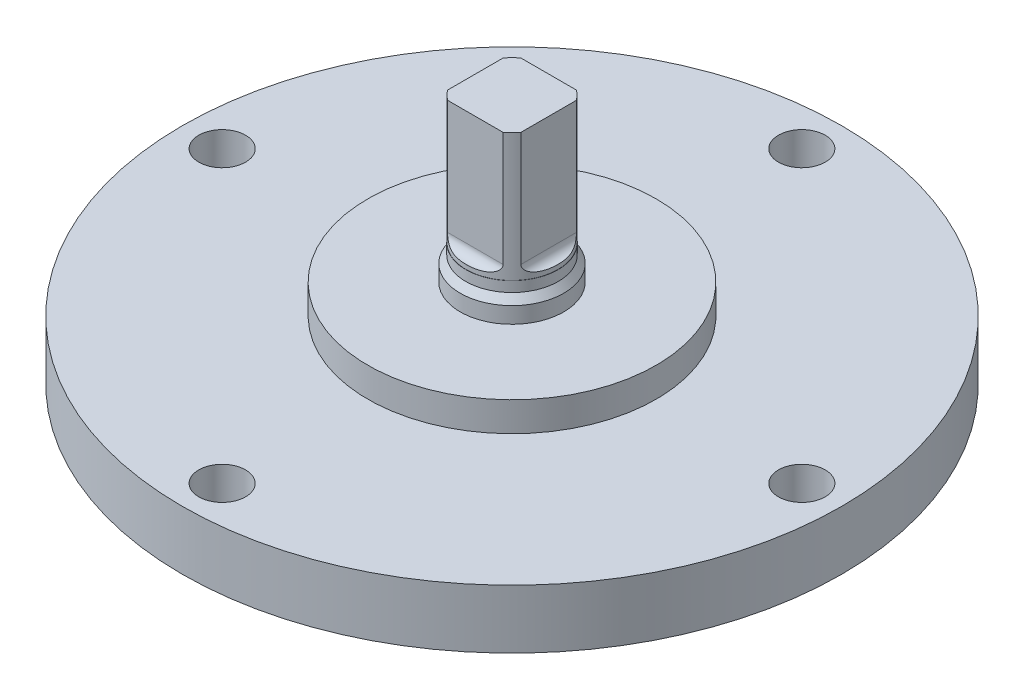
ISO-10303-21;
HEADER;
FILE_DESCRIPTION(('STEP AP214'),'2;1');
FILE_NAME('part.step','',(''),(''),'','','');
FILE_SCHEMA(('AUTOMOTIVE_DESIGN { 1 0 10303 214 1 1 1 1 }'));
ENDSEC;
DATA;
#1=APPLICATION_CONTEXT('core data for automotive mechanical design processes');
#2=APPLICATION_PROTOCOL_DEFINITION('international standard','automotive_design',2000,#1);
#3=PRODUCT_CONTEXT('',#1,'mechanical');
#4=PRODUCT('Part','Part','',(#3));
#5=PRODUCT_RELATED_PRODUCT_CATEGORY('part','',(#4));
#6=PRODUCT_DEFINITION_FORMATION('','',#4);
#7=PRODUCT_DEFINITION_CONTEXT('part definition',#1,'design');
#8=PRODUCT_DEFINITION('design','',#6,#7);
#9=PRODUCT_DEFINITION_SHAPE('','',#8);
#10=(LENGTH_UNIT() NAMED_UNIT(*) SI_UNIT(.MILLI.,.METRE.));
#11=(NAMED_UNIT(*) PLANE_ANGLE_UNIT() SI_UNIT($,.RADIAN.));
#12=(NAMED_UNIT(*) SI_UNIT($,.STERADIAN.) SOLID_ANGLE_UNIT());
#13=UNCERTAINTY_MEASURE_WITH_UNIT(LENGTH_MEASURE(1.E-05),#10,'distance_accuracy_value','');
#14=(GEOMETRIC_REPRESENTATION_CONTEXT(3) GLOBAL_UNCERTAINTY_ASSIGNED_CONTEXT((#13)) GLOBAL_UNIT_ASSIGNED_CONTEXT((#10,
#11,#12)) REPRESENTATION_CONTEXT('',''));
#15=CARTESIAN_POINT('',(0.,0.,0.));
#16=DIRECTION('',(0.,0.,1.));
#17=DIRECTION('',(1.,0.,0.));
#18=AXIS2_PLACEMENT_3D('',#15,#16,#17);
#19=CARTESIAN_POINT('',(0.,21.59,0.));
#20=DIRECTION('',(0.,1.,0.));
#21=DIRECTION('',(0.,0.,1.));
#22=AXIS2_PLACEMENT_3D('',#19,#20,#21);
#23=PLANE('',#22);
#24=CARTESIAN_POINT('',(0.,21.59,0.));
#25=DIRECTION('',(0.,-1.,0.));
#26=DIRECTION('',(0.,0.,-1.));
#27=AXIS2_PLACEMENT_3D('',#24,#25,#26);
#28=CIRCLE('',#27,3.96875);
#29=CARTESIAN_POINT('',(2.39808992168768,21.59,-3.1623));
#30=VERTEX_POINT('',#29);
#31=CARTESIAN_POINT('',(3.1623,21.59,-2.39808992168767));
#32=VERTEX_POINT('',#31);
#33=EDGE_CURVE('E148',#30,#32,#28,.T.);
#34=ORIENTED_EDGE('',*,*,#33,.F.);
#35=DIRECTION('',(-1.,0.,0.));
#36=VECTOR('',#35,1.);
#37=CARTESIAN_POINT('',(-2.39808992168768,21.59,-3.1623));
#38=LINE('',#37,#36);
#39=CARTESIAN_POINT('',(-2.39808992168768,21.59,-3.1623));
#40=VERTEX_POINT('',#39);
#41=EDGE_CURVE('E474',#30,#40,#38,.T.);
#42=ORIENTED_EDGE('',*,*,#41,.T.);
#43=CARTESIAN_POINT('',(-3.1623,21.59,-2.39808992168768));
#44=VERTEX_POINT('',#43);
#45=EDGE_CURVE('E137',#44,#40,#28,.T.);
#46=ORIENTED_EDGE('',*,*,#45,.F.);
#47=DIRECTION('',(0.,0.,1.));
#48=VECTOR('',#47,1.);
#49=CARTESIAN_POINT('',(-3.1623,21.59,2.39808992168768));
#50=LINE('',#49,#48);
#51=CARTESIAN_POINT('',(-3.1623,21.59,2.39808992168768));
#52=VERTEX_POINT('',#51);
#53=EDGE_CURVE('E122',#44,#52,#50,.T.);
#54=ORIENTED_EDGE('',*,*,#53,.T.);
#55=CARTESIAN_POINT('',(-2.39808992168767,21.59,3.1623));
#56=VERTEX_POINT('',#55);
#57=EDGE_CURVE('E134',#56,#52,#28,.T.);
#58=ORIENTED_EDGE('',*,*,#57,.F.);
#59=DIRECTION('',(1.,0.,0.));
#60=VECTOR('',#59,1.);
#61=CARTESIAN_POINT('',(2.39808992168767,21.59,3.1623));
#62=LINE('',#61,#60);
#63=CARTESIAN_POINT('',(2.39808992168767,21.59,3.1623));
#64=VERTEX_POINT('',#63);
#65=EDGE_CURVE('E138',#56,#64,#62,.T.);
#66=ORIENTED_EDGE('',*,*,#65,.T.);
#67=CARTESIAN_POINT('',(3.1623,21.59,2.39808992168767));
#68=VERTEX_POINT('',#67);
#69=EDGE_CURVE('E145',#68,#64,#28,.T.);
#70=ORIENTED_EDGE('',*,*,#69,.F.);
#71=DIRECTION('',(0.,0.,-1.));
#72=VECTOR('',#71,1.);
#73=CARTESIAN_POINT('',(3.1623,21.59,-2.39808992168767));
#74=LINE('',#73,#72);
#75=EDGE_CURVE('E471',#68,#32,#74,.T.);
#76=ORIENTED_EDGE('',*,*,#75,.T.);
#77=EDGE_LOOP('',(#34,#42,#46,#54,#58,#66,#70,#76));
#78=FACE_BOUND('',#77,.T.);
#79=ADVANCED_FACE('F28',(#78),#23,.T.);
#80=CARTESIAN_POINT('',(0.,0.,0.));
#81=DIRECTION('',(0.,-1.,0.));
#82=DIRECTION('',(0.,0.,-1.));
#83=AXIS2_PLACEMENT_3D('',#80,#81,#82);
#84=CYLINDRICAL_SURFACE('',#83,3.96875);
#85=DIRECTION('',(0.,1.,0.));
#86=VECTOR('',#85,1.);
#87=CARTESIAN_POINT('',(-3.1623,10.922,2.39808992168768));
#88=LINE('',#87,#86);
#89=CARTESIAN_POINT('',(-3.1623,11.71448,2.39808992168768));
#90=VERTEX_POINT('',#89);
#91=EDGE_CURVE('E118',#90,#52,#88,.T.);
#92=ORIENTED_EDGE('',*,*,#91,.F.);
#93=CARTESIAN_POINT('',(-3.1623,11.71448,2.39808992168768));
#94=CARTESIAN_POINT('',(-3.16229742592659,11.6986815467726,2.39809203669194));
#95=CARTESIAN_POINT('',(-3.16277291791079,11.6828936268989,2.39746640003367));
#96=CARTESIAN_POINT('',(-3.16465170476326,11.6514838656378,2.3949864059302));
#97=CARTESIAN_POINT('',(-3.1660541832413,11.6358618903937,2.39313312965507));
#98=CARTESIAN_POINT('',(-3.17157138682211,11.5897510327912,2.38582270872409));
#99=CARTESIAN_POINT('',(-3.17699722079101,11.5596743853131,2.37861362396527));
#100=CARTESIAN_POINT('',(-3.19081354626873,11.5017159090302,2.36004571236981));
#101=CARTESIAN_POINT('',(-3.19919495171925,11.473827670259,2.34869960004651));
#102=CARTESIAN_POINT('',(-3.21827527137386,11.4205611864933,2.32248677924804));
#103=CARTESIAN_POINT('',(-3.22897994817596,11.3951894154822,2.30761130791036));
#104=CARTESIAN_POINT('',(-3.25690781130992,11.3370765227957,2.26811073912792));
#105=CARTESIAN_POINT('',(-3.27497566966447,11.3057427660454,2.24202016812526));
#106=CARTESIAN_POINT('',(-3.31288727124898,11.2484514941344,2.18561669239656));
#107=CARTESIAN_POINT('',(-3.33273426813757,11.2225041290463,2.15529599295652));
#108=CARTESIAN_POINT('',(-3.38491538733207,11.1615706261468,2.07288981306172));
#109=CARTESIAN_POINT('',(-3.41774854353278,11.1302040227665,2.01846606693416));
#110=CARTESIAN_POINT('',(-3.48241887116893,11.0767801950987,1.9047464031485));
#111=CARTESIAN_POINT('',(-3.51425353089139,11.0547449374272,1.84543937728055));
#112=CARTESIAN_POINT('',(-3.57333405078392,11.0190518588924,1.72807892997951));
#113=CARTESIAN_POINT('',(-3.60074519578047,11.0048966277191,1.6702547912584));
#114=CARTESIAN_POINT('',(-3.65304701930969,10.9811265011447,1.55253976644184));
#115=CARTESIAN_POINT('',(-3.67793542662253,10.971515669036,1.49264708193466));
#116=CARTESIAN_POINT('',(-3.72494096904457,10.9556554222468,1.37114889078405));
#117=CARTESIAN_POINT('',(-3.74704920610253,10.9494165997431,1.30953861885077));
#118=CARTESIAN_POINT('',(-3.78824145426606,10.9394068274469,1.1851158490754));
#119=CARTESIAN_POINT('',(-3.80732490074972,10.935636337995,1.12230312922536));
#120=CARTESIAN_POINT('',(-3.84134380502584,10.9299826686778,0.999438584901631));
#121=CARTESIAN_POINT('',(-3.85645647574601,10.9280020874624,0.939439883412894));
#122=CARTESIAN_POINT('',(-3.88386565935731,10.9250592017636,0.818774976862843));
#123=CARTESIAN_POINT('',(-3.89616195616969,10.9240969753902,0.758108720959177));
#124=CARTESIAN_POINT('',(-3.91780026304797,10.9227886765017,0.636846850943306));
#125=CARTESIAN_POINT('',(-3.92716946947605,10.9224367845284,0.576256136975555));
#126=CARTESIAN_POINT('',(-3.94309098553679,10.9220505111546,0.454717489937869));
#127=CARTESIAN_POINT('',(-3.94964388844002,10.9220160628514,0.393769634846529));
#128=CARTESIAN_POINT('',(-3.95478,10.922,0.332703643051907));
#129=B_SPLINE_CURVE_WITH_KNOTS('',3,(#93,#94,#95,#96,#97,#98,#99,#100,#101,#102,#103,#104,#105,
#106,#107,#108,#109,#110,#111,#112,#113,#114,#115,#116,#117,#118,#119,#120,#121,#122,#123,#124,
#125,#126,#127,#128),.UNSPECIFIED.,.F.,.F.,(4,2,2,2,2,2,2,2,2,2,2,2,2,2,2,2,2,4),(0.,
0.0473559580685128,0.0946702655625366,0.188287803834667,0.281620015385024,0.375186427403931,
0.508230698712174,0.641523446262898,0.852963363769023,1.06489829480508,1.26122676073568,
1.45773043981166,1.65484784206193,1.85200199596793,2.0376366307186,2.22328550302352,
2.40715430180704,2.59098434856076),.UNSPECIFIED.);
#130=CARTESIAN_POINT('',(-3.95478,10.922,0.332703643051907));
#131=VERTEX_POINT('',#130);
#132=EDGE_CURVE('E39',#90,#131,#129,.T.);
#133=ORIENTED_EDGE('',*,*,#132,.T.);
#134=CARTESIAN_POINT('',(0.,10.922,0.));
#135=DIRECTION('',(0.,1.,0.));
#136=DIRECTION('',(0.,0.,1.));
#137=AXIS2_PLACEMENT_3D('',#134,#135,#136);
#138=CIRCLE('',#137,3.96875);
#139=CARTESIAN_POINT('',(-3.95478,10.922,-0.332703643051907));
#140=VERTEX_POINT('',#139);
#141=EDGE_CURVE('E153',#131,#140,#138,.F.);
#142=ORIENTED_EDGE('',*,*,#141,.T.);
#143=CARTESIAN_POINT('',(-3.95478,10.922,-0.332703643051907));
#144=CARTESIAN_POINT('',(-3.95030195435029,10.922009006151,-0.385938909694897));
#145=CARTESIAN_POINT('',(-3.94474804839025,10.922038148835,-0.439083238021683));
#146=CARTESIAN_POINT('',(-3.93149913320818,10.9223119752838,-0.545110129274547));
#147=CARTESIAN_POINT('',(-3.92380386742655,10.9225566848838,-0.597992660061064));
#148=CARTESIAN_POINT('',(-3.90624057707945,10.9234391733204,-0.703664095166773));
#149=CARTESIAN_POINT('',(-3.89636198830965,10.9240788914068,-0.756451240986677));
#150=CARTESIAN_POINT('',(-3.87447733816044,10.9260034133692,-0.861560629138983));
#151=CARTESIAN_POINT('',(-3.86247138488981,10.9272881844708,-0.913882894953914));
#152=CARTESIAN_POINT('',(-3.82301721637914,10.9325688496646,-1.07109774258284));
#153=CARTESIAN_POINT('',(-3.79230886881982,10.9379934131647,-1.17517607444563));
#154=CARTESIAN_POINT('',(-3.74015317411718,10.9514106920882,-1.32858883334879));
#155=CARTESIAN_POINT('',(-3.72177542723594,10.9567546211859,-1.37922265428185));
#156=CARTESIAN_POINT('',(-3.68308509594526,10.9697485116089,-1.47943907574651));
#157=CARTESIAN_POINT('',(-3.662773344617,10.9773974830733,-1.52902211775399));
#158=CARTESIAN_POINT('',(-3.62999630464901,10.9915012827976,-1.60466589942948));
#159=CARTESIAN_POINT('',(-3.61815268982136,10.9969230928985,-1.63119119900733));
#160=CARTESIAN_POINT('',(-3.59397589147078,11.0087703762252,-1.68379109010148));
#161=CARTESIAN_POINT('',(-3.58164268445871,11.0151958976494,-1.70986565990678));
#162=CARTESIAN_POINT('',(-3.54399650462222,11.0361665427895,-1.78727395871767));
#163=CARTESIAN_POINT('',(-3.51801325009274,11.0524153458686,-1.83784687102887));
#164=CARTESIAN_POINT('',(-3.46466464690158,11.0908588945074,-1.93655584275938));
#165=CARTESIAN_POINT('',(-3.43728972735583,11.1131012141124,-1.98466857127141));
#166=CARTESIAN_POINT('',(-3.38246498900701,11.1650231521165,-2.07671689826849));
#167=CARTESIAN_POINT('',(-3.35501538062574,11.194689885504,-2.12065955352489));
#168=CARTESIAN_POINT('',(-3.31157346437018,11.2507217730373,-2.18756438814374));
#169=CARTESIAN_POINT('',(-3.29501725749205,11.2744236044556,-2.21238038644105));
#170=CARTESIAN_POINT('',(-3.26347166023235,11.3258596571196,-2.2586518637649));
#171=CARTESIAN_POINT('',(-3.24848104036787,11.3535906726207,-2.28010998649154));
#172=CARTESIAN_POINT('',(-3.2232712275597,11.4084102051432,-2.3155772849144));
#173=CARTESIAN_POINT('',(-3.21267236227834,11.4349041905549,-2.3302280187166));
#174=CARTESIAN_POINT('',(-3.19405369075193,11.4904802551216,-2.35568358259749));
#175=CARTESIAN_POINT('',(-3.18602764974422,11.5195558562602,-2.3664977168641));
#176=CARTESIAN_POINT('',(-3.1740424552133,11.5759442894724,-2.38254582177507));
#177=CARTESIAN_POINT('',(-3.16970050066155,11.603023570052,-2.38830812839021));
#178=CARTESIAN_POINT('',(-3.16379958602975,11.6582055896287,-2.39611269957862));
#179=CARTESIAN_POINT('',(-3.16226124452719,11.6863143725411,-2.39812740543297));
#180=CARTESIAN_POINT('',(-3.1623,11.71448,-2.39808992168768));
#181=B_SPLINE_CURVE_WITH_KNOTS('',3,(#143,#144,#145,#146,#147,#148,#149,#150,#151,#152,#153,
#154,#155,#156,#157,#158,#159,#160,#161,#162,#163,#164,#165,#166,#167,#168,#169,#170,#171,#172,
#173,#174,#175,#176,#177,#178,#179,#180),.UNSPECIFIED.,.F.,.F.,(4,2,2,2,2,2,2,2,2,2,2,2,2,2,2,2,
2,2,4),(0.,0.160257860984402,0.320534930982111,0.481605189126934,0.642667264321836,
0.968012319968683,1.13033627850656,1.2925906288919,1.38122147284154,1.46985657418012,
1.64694646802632,1.82548568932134,2.00371718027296,2.11771547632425,2.23162356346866,
2.32748138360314,2.42310512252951,2.50678299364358,2.59107381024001),.UNSPECIFIED.);
#182=CARTESIAN_POINT('',(-3.1623,11.71448,-2.39808992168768));
#183=VERTEX_POINT('',#182);
#184=EDGE_CURVE('E11',#140,#183,#181,.T.);
#185=ORIENTED_EDGE('',*,*,#184,.T.);
#186=DIRECTION('',(0.,1.,0.));
#187=VECTOR('',#186,1.);
#188=CARTESIAN_POINT('',(-3.1623,10.922,-2.39808992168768));
#189=LINE('',#188,#187);
#190=EDGE_CURVE('E128',#183,#44,#189,.T.);
#191=ORIENTED_EDGE('',*,*,#190,.T.);
#192=ORIENTED_EDGE('',*,*,#45,.T.);
#193=DIRECTION('',(0.,1.,0.));
#194=VECTOR('',#193,1.);
#195=CARTESIAN_POINT('',(-2.39808992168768,10.922,-3.1623));
#196=LINE('',#195,#194);
#197=CARTESIAN_POINT('',(-2.39808992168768,11.71448,-3.1623));
#198=VERTEX_POINT('',#197);
#199=EDGE_CURVE('E476',#198,#40,#196,.T.);
#200=ORIENTED_EDGE('',*,*,#199,.F.);
#201=CARTESIAN_POINT('',(-2.39808992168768,11.71448,-3.1623));
#202=CARTESIAN_POINT('',(-2.39809203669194,11.6986815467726,-3.16229742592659));
#203=CARTESIAN_POINT('',(-2.39746640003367,11.6828936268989,-3.16277291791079));
#204=CARTESIAN_POINT('',(-2.3949864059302,11.6514838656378,-3.16465170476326));
#205=CARTESIAN_POINT('',(-2.39313312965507,11.6358618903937,-3.1660541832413));
#206=CARTESIAN_POINT('',(-2.38582270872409,11.5897510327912,-3.17157138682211));
#207=CARTESIAN_POINT('',(-2.37861362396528,11.5596743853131,-3.17699722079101));
#208=CARTESIAN_POINT('',(-2.36004571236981,11.5017159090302,-3.19081354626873));
#209=CARTESIAN_POINT('',(-2.34869960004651,11.473827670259,-3.19919495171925));
#210=CARTESIAN_POINT('',(-2.32248677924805,11.4205611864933,-3.21827527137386));
#211=CARTESIAN_POINT('',(-2.30761130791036,11.3951894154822,-3.22897994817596));
#212=CARTESIAN_POINT('',(-2.26811073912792,11.3370765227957,-3.25690781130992));
#213=CARTESIAN_POINT('',(-2.24202016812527,11.3057427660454,-3.27497566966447));
#214=CARTESIAN_POINT('',(-2.18561669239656,11.2484514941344,-3.31288727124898));
#215=CARTESIAN_POINT('',(-2.15529599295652,11.2225041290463,-3.33273426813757));
#216=CARTESIAN_POINT('',(-2.07288981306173,11.1615706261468,-3.38491538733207));
#217=CARTESIAN_POINT('',(-2.01846606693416,11.1302040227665,-3.41774854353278));
#218=CARTESIAN_POINT('',(-1.9047464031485,11.0767801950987,-3.48241887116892));
#219=CARTESIAN_POINT('',(-1.84543937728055,11.0547449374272,-3.51425353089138));
#220=CARTESIAN_POINT('',(-1.72807892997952,11.0190518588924,-3.57333405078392));
#221=CARTESIAN_POINT('',(-1.6702547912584,11.0048966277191,-3.60074519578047));
#222=CARTESIAN_POINT('',(-1.55253976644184,10.9811265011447,-3.65304701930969));
#223=CARTESIAN_POINT('',(-1.49264708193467,10.971515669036,-3.67793542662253));
#224=CARTESIAN_POINT('',(-1.37114889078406,10.9556554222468,-3.72494096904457));
#225=CARTESIAN_POINT('',(-1.30953861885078,10.9494165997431,-3.74704920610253));
#226=CARTESIAN_POINT('',(-1.1851158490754,10.9394068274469,-3.78824145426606));
#227=CARTESIAN_POINT('',(-1.12230312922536,10.935636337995,-3.80732490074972));
#228=CARTESIAN_POINT('',(-0.999438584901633,10.9299826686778,-3.84134380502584));
#229=CARTESIAN_POINT('',(-0.939439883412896,10.9280020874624,-3.85645647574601));
#230=CARTESIAN_POINT('',(-0.818774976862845,10.9250592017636,-3.88386565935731));
#231=CARTESIAN_POINT('',(-0.758108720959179,10.9240969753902,-3.89616195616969));
#232=CARTESIAN_POINT('',(-0.636846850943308,10.9227886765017,-3.91780026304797));
#233=CARTESIAN_POINT('',(-0.576256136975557,10.9224367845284,-3.92716946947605));
#234=CARTESIAN_POINT('',(-0.45471748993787,10.9220505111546,-3.94309098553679));
#235=CARTESIAN_POINT('',(-0.39376963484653,10.9220160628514,-3.94964388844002));
#236=CARTESIAN_POINT('',(-0.332703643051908,10.922,-3.95478));
#237=B_SPLINE_CURVE_WITH_KNOTS('',3,(#201,#202,#203,#204,#205,#206,#207,#208,#209,#210,#211,
#212,#213,#214,#215,#216,#217,#218,#219,#220,#221,#222,#223,#224,#225,#226,#227,#228,#229,#230,
#231,#232,#233,#234,#235,#236),.UNSPECIFIED.,.F.,.F.,(4,2,2,2,2,2,2,2,2,2,2,2,2,2,2,2,2,4),(0.,
0.0473559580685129,0.0946702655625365,0.188287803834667,0.281620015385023,0.375186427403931,
0.508230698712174,0.641523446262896,0.85296336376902,1.06489829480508,1.26122676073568,
1.45773043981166,1.65484784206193,1.85200199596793,2.0376366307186,2.22328550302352,
2.40715430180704,2.59098434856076),.UNSPECIFIED.);
#238=CARTESIAN_POINT('',(-0.332703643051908,10.922,-3.95478));
#239=VERTEX_POINT('',#238);
#240=EDGE_CURVE('E213',#198,#239,#237,.T.);
#241=ORIENTED_EDGE('',*,*,#240,.T.);
#242=CARTESIAN_POINT('',(0.332703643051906,10.922,-3.95478));
#243=VERTEX_POINT('',#242);
#244=EDGE_CURVE('E157',#239,#243,#138,.F.);
#245=ORIENTED_EDGE('',*,*,#244,.T.);
#246=CARTESIAN_POINT('',(0.332703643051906,10.922,-3.95478));
#247=CARTESIAN_POINT('',(0.385938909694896,10.922009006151,-3.95030195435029));
#248=CARTESIAN_POINT('',(0.439083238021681,10.922038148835,-3.94474804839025));
#249=CARTESIAN_POINT('',(0.545110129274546,10.9223119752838,-3.93149913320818));
#250=CARTESIAN_POINT('',(0.597992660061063,10.9225566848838,-3.92380386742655));
#251=CARTESIAN_POINT('',(0.703664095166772,10.9234391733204,-3.90624057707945));
#252=CARTESIAN_POINT('',(0.756451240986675,10.9240788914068,-3.89636198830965));
#253=CARTESIAN_POINT('',(0.861560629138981,10.9260034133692,-3.87447733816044));
#254=CARTESIAN_POINT('',(0.913882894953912,10.9272881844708,-3.86247138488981));
#255=CARTESIAN_POINT('',(1.07109774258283,10.9325688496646,-3.82301721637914));
#256=CARTESIAN_POINT('',(1.17517607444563,10.9379934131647,-3.79230886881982));
#257=CARTESIAN_POINT('',(1.32858883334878,10.9514106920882,-3.74015317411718));
#258=CARTESIAN_POINT('',(1.37922265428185,10.9567546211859,-3.72177542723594));
#259=CARTESIAN_POINT('',(1.4794390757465,10.9697485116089,-3.68308509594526));
#260=CARTESIAN_POINT('',(1.52902211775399,10.9773974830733,-3.662773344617));
#261=CARTESIAN_POINT('',(1.60466589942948,10.9915012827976,-3.62999630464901));
#262=CARTESIAN_POINT('',(1.63119119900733,10.9969230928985,-3.61815268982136));
#263=CARTESIAN_POINT('',(1.68379109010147,11.0087703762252,-3.59397589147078));
#264=CARTESIAN_POINT('',(1.70986565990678,11.0151958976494,-3.58164268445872));
#265=CARTESIAN_POINT('',(1.78727395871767,11.0361665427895,-3.54399650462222));
#266=CARTESIAN_POINT('',(1.83784687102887,11.0524153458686,-3.51801325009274));
#267=CARTESIAN_POINT('',(1.93655584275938,11.0908588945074,-3.46466464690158));
#268=CARTESIAN_POINT('',(1.98466857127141,11.1131012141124,-3.43728972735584));
#269=CARTESIAN_POINT('',(2.07671689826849,11.1650231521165,-3.38246498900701));
#270=CARTESIAN_POINT('',(2.12065955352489,11.194689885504,-3.35501538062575));
#271=CARTESIAN_POINT('',(2.18756438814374,11.2507217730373,-3.31157346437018));
#272=CARTESIAN_POINT('',(2.21238038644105,11.2744236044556,-3.29501725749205));
#273=CARTESIAN_POINT('',(2.2586518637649,11.3258596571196,-3.26347166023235));
#274=CARTESIAN_POINT('',(2.28010998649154,11.3535906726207,-3.24848104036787));
#275=CARTESIAN_POINT('',(2.3155772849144,11.4084102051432,-3.2232712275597));
#276=CARTESIAN_POINT('',(2.3302280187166,11.4349041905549,-3.21267236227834));
#277=CARTESIAN_POINT('',(2.35568358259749,11.4904802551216,-3.19405369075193));
#278=CARTESIAN_POINT('',(2.3664977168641,11.5195558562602,-3.18602764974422));
#279=CARTESIAN_POINT('',(2.38254582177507,11.5759442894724,-3.1740424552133));
#280=CARTESIAN_POINT('',(2.38830812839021,11.603023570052,-3.16970050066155));
#281=CARTESIAN_POINT('',(2.39611269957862,11.6582055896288,-3.16379958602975));
#282=CARTESIAN_POINT('',(2.39812740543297,11.6863143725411,-3.16226124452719));
#283=CARTESIAN_POINT('',(2.39808992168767,11.71448,-3.1623));
#284=B_SPLINE_CURVE_WITH_KNOTS('',3,(#246,#247,#248,#249,#250,#251,#252,#253,#254,#255,#256,
#257,#258,#259,#260,#261,#262,#263,#264,#265,#266,#267,#268,#269,#270,#271,#272,#273,#274,#275,
#276,#277,#278,#279,#280,#281,#282,#283),.UNSPECIFIED.,.F.,.F.,(4,2,2,2,2,2,2,2,2,2,2,2,2,2,2,2,
2,2,4),(0.,0.160257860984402,0.320534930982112,0.481605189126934,0.642667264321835,
0.968012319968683,1.13033627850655,1.2925906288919,1.38122147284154,1.46985657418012,
1.64694646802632,1.82548568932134,2.00371718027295,2.11771547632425,2.23162356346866,
2.32748138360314,2.42310512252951,2.50678299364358,2.59107381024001),.UNSPECIFIED.);
#285=CARTESIAN_POINT('',(2.39808992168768,11.71448,-3.1623));
#286=VERTEX_POINT('',#285);
#287=EDGE_CURVE('E219',#243,#286,#284,.T.);
#288=ORIENTED_EDGE('',*,*,#287,.T.);
#289=DIRECTION('',(0.,1.,0.));
#290=VECTOR('',#289,1.);
#291=CARTESIAN_POINT('',(2.39808992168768,10.922,-3.1623));
#292=LINE('',#291,#290);
#293=EDGE_CURVE('E479',#286,#30,#292,.T.);
#294=ORIENTED_EDGE('',*,*,#293,.T.);
#295=ORIENTED_EDGE('',*,*,#33,.T.);
#296=DIRECTION('',(0.,1.,0.));
#297=VECTOR('',#296,1.);
#298=CARTESIAN_POINT('',(3.1623,10.922,-2.39808992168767));
#299=LINE('',#298,#297);
#300=CARTESIAN_POINT('',(3.1623,11.71448,-2.39808992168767));
#301=VERTEX_POINT('',#300);
#302=EDGE_CURVE('E481',#301,#32,#299,.T.);
#303=ORIENTED_EDGE('',*,*,#302,.F.);
#304=CARTESIAN_POINT('',(3.1623,11.71448,-2.39808992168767));
#305=CARTESIAN_POINT('',(3.16229742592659,11.6986815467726,-2.39809203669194));
#306=CARTESIAN_POINT('',(3.16277291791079,11.6828936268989,-2.39746640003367));
#307=CARTESIAN_POINT('',(3.16465170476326,11.6514838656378,-2.39498640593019));
#308=CARTESIAN_POINT('',(3.16605418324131,11.6358618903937,-2.39313312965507));
#309=CARTESIAN_POINT('',(3.17157138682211,11.5897510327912,-2.38582270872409));
#310=CARTESIAN_POINT('',(3.17699722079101,11.5596743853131,-2.37861362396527));
#311=CARTESIAN_POINT('',(3.19081354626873,11.5017159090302,-2.3600457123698));
#312=CARTESIAN_POINT('',(3.19919495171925,11.473827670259,-2.34869960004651));
#313=CARTESIAN_POINT('',(3.21827527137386,11.4205611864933,-2.32248677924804));
#314=CARTESIAN_POINT('',(3.22897994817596,11.3951894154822,-2.30761130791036));
#315=CARTESIAN_POINT('',(3.25690781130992,11.3370765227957,-2.26811073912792));
#316=CARTESIAN_POINT('',(3.27497566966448,11.3057427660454,-2.24202016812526));
#317=CARTESIAN_POINT('',(3.31288727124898,11.2484514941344,-2.18561669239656));
#318=CARTESIAN_POINT('',(3.33273426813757,11.2225041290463,-2.15529599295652));
#319=CARTESIAN_POINT('',(3.38491538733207,11.1615706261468,-2.07288981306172));
#320=CARTESIAN_POINT('',(3.41774854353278,11.1302040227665,-2.01846606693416));
#321=CARTESIAN_POINT('',(3.48241887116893,11.0767801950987,-1.9047464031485));
#322=CARTESIAN_POINT('',(3.51425353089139,11.0547449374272,-1.84543937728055));
#323=CARTESIAN_POINT('',(3.57333405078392,11.0190518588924,-1.72807892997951));
#324=CARTESIAN_POINT('',(3.60074519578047,11.0048966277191,-1.6702547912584));
#325=CARTESIAN_POINT('',(3.65304701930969,10.9811265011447,-1.55253976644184));
#326=CARTESIAN_POINT('',(3.67793542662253,10.971515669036,-1.49264708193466));
#327=CARTESIAN_POINT('',(3.72494096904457,10.9556554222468,-1.37114889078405));
#328=CARTESIAN_POINT('',(3.74704920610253,10.9494165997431,-1.30953861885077));
#329=CARTESIAN_POINT('',(3.78824145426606,10.9394068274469,-1.1851158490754));
#330=CARTESIAN_POINT('',(3.80732490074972,10.935636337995,-1.12230312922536));
#331=CARTESIAN_POINT('',(3.84134380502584,10.9299826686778,-0.99943858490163));
#332=CARTESIAN_POINT('',(3.85645647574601,10.9280020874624,-0.939439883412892));
#333=CARTESIAN_POINT('',(3.88386565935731,10.9250592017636,-0.818774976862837));
#334=CARTESIAN_POINT('',(3.89616195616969,10.9240969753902,-0.758108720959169));
#335=CARTESIAN_POINT('',(3.91780026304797,10.9227886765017,-0.636846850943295));
#336=CARTESIAN_POINT('',(3.92716946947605,10.9224367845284,-0.576256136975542));
#337=CARTESIAN_POINT('',(3.94309098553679,10.9220505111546,-0.454717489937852));
#338=CARTESIAN_POINT('',(3.94964388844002,10.9220160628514,-0.39376963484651));
#339=CARTESIAN_POINT('',(3.95478,10.922,-0.332703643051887));
#340=B_SPLINE_CURVE_WITH_KNOTS('',3,(#304,#305,#306,#307,#308,#309,#310,#311,#312,#313,#314,
#315,#316,#317,#318,#319,#320,#321,#322,#323,#324,#325,#326,#327,#328,#329,#330,#331,#332,#333,
#334,#335,#336,#337,#338,#339),.UNSPECIFIED.,.F.,.F.,(4,2,2,2,2,2,2,2,2,2,2,2,2,2,2,2,2,4),(0.,
0.0473559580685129,0.0946702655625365,0.188287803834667,0.281620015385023,0.375186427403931,
0.508230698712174,0.641523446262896,0.85296336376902,1.06489829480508,1.26122676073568,
1.45773043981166,1.65484784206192,1.85200199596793,2.0376366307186,2.22328550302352,
2.40715430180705,2.59098434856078),.UNSPECIFIED.);
#341=CARTESIAN_POINT('',(3.95478,10.922,-0.332703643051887));
#342=VERTEX_POINT('',#341);
#343=EDGE_CURVE('E176',#301,#342,#340,.T.);
#344=ORIENTED_EDGE('',*,*,#343,.T.);
#345=CARTESIAN_POINT('',(3.95478,10.922,0.332703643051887));
#346=VERTEX_POINT('',#345);
#347=EDGE_CURVE('E158',#342,#346,#138,.F.);
#348=ORIENTED_EDGE('',*,*,#347,.T.);
#349=CARTESIAN_POINT('',(3.95478,10.922,0.332703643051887));
#350=CARTESIAN_POINT('',(3.95030195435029,10.922009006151,0.385938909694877));
#351=CARTESIAN_POINT('',(3.94474804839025,10.922038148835,0.439083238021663));
#352=CARTESIAN_POINT('',(3.93149913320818,10.9223119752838,0.545110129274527));
#353=CARTESIAN_POINT('',(3.92380386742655,10.9225566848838,0.597992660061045));
#354=CARTESIAN_POINT('',(3.90624057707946,10.9234391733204,0.703664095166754));
#355=CARTESIAN_POINT('',(3.89636198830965,10.9240788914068,0.756451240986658));
#356=CARTESIAN_POINT('',(3.87447733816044,10.9260034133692,0.861560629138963));
#357=CARTESIAN_POINT('',(3.86247138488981,10.9272881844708,0.913882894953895));
#358=CARTESIAN_POINT('',(3.82301721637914,10.9325688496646,1.07109774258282));
#359=CARTESIAN_POINT('',(3.79230886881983,10.9379934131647,1.17517607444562));
#360=CARTESIAN_POINT('',(3.74015317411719,10.9514106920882,1.32858883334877));
#361=CARTESIAN_POINT('',(3.72177542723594,10.9567546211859,1.37922265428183));
#362=CARTESIAN_POINT('',(3.68308509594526,10.9697485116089,1.47943907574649));
#363=CARTESIAN_POINT('',(3.662773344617,10.9773974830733,1.52902211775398));
#364=CARTESIAN_POINT('',(3.62999630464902,10.9915012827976,1.60466589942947));
#365=CARTESIAN_POINT('',(3.61815268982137,10.9969230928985,1.63119119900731));
#366=CARTESIAN_POINT('',(3.59397589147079,11.0087703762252,1.68379109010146));
#367=CARTESIAN_POINT('',(3.58164268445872,11.0151958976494,1.70986565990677));
#368=CARTESIAN_POINT('',(3.54399650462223,11.0361665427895,1.78727395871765));
#369=CARTESIAN_POINT('',(3.51801325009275,11.0524153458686,1.83784687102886));
#370=CARTESIAN_POINT('',(3.46466464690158,11.0908588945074,1.93655584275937));
#371=CARTESIAN_POINT('',(3.43728972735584,11.1131012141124,1.9846685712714));
#372=CARTESIAN_POINT('',(3.38246498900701,11.1650231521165,2.07671689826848));
#373=CARTESIAN_POINT('',(3.35501538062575,11.194689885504,2.12065955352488));
#374=CARTESIAN_POINT('',(3.31157346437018,11.2507217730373,2.18756438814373));
#375=CARTESIAN_POINT('',(3.29501725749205,11.2744236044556,2.21238038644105));
#376=CARTESIAN_POINT('',(3.26347166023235,11.3258596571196,2.2586518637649));
#377=CARTESIAN_POINT('',(3.24848104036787,11.3535906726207,2.28010998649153));
#378=CARTESIAN_POINT('',(3.22327122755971,11.4084102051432,2.3155772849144));
#379=CARTESIAN_POINT('',(3.21267236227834,11.4349041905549,2.3302280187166));
#380=CARTESIAN_POINT('',(3.19405369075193,11.4904802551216,2.35568358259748));
#381=CARTESIAN_POINT('',(3.18602764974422,11.5195558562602,2.3664977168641));
#382=CARTESIAN_POINT('',(3.1740424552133,11.5759442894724,2.38254582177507));
#383=CARTESIAN_POINT('',(3.16970050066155,11.603023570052,2.38830812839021));
#384=CARTESIAN_POINT('',(3.16379958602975,11.6582055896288,2.39611269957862));
#385=CARTESIAN_POINT('',(3.16226124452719,11.6863143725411,2.39812740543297));
#386=CARTESIAN_POINT('',(3.1623,11.71448,2.39808992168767));
#387=B_SPLINE_CURVE_WITH_KNOTS('',3,(#349,#350,#351,#352,#353,#354,#355,#356,#357,#358,#359,
#360,#361,#362,#363,#364,#365,#366,#367,#368,#369,#370,#371,#372,#373,#374,#375,#376,#377,#378,
#379,#380,#381,#382,#383,#384,#385,#386),.UNSPECIFIED.,.F.,.F.,(4,2,2,2,2,2,2,2,2,2,2,2,2,2,2,2,
2,2,4),(0.,0.160257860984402,0.320534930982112,0.481605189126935,0.642667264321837,
0.968012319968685,1.13033627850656,1.2925906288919,1.38122147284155,1.46985657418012,
1.64694646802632,1.82548568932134,2.00371718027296,2.11771547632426,2.23162356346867,
2.32748138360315,2.42310512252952,2.5067829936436,2.59107381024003),.UNSPECIFIED.);
#388=CARTESIAN_POINT('',(3.1623,11.71448,2.39808992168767));
#389=VERTEX_POINT('',#388);
#390=EDGE_CURVE('E182',#346,#389,#387,.T.);
#391=ORIENTED_EDGE('',*,*,#390,.T.);
#392=DIRECTION('',(0.,1.,0.));
#393=VECTOR('',#392,1.);
#394=CARTESIAN_POINT('',(3.1623,10.922,2.39808992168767));
#395=LINE('',#394,#393);
#396=EDGE_CURVE('E483',#389,#68,#395,.T.);
#397=ORIENTED_EDGE('',*,*,#396,.T.);
#398=ORIENTED_EDGE('',*,*,#69,.T.);
#399=DIRECTION('',(0.,1.,0.));
#400=VECTOR('',#399,1.);
#401=CARTESIAN_POINT('',(2.39808992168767,10.922,3.1623));
#402=LINE('',#401,#400);
#403=CARTESIAN_POINT('',(2.39808992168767,11.71448,3.1623));
#404=VERTEX_POINT('',#403);
#405=EDGE_CURVE('E485',#404,#64,#402,.T.);
#406=ORIENTED_EDGE('',*,*,#405,.F.);
#407=CARTESIAN_POINT('',(2.39808992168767,11.71448,3.1623));
#408=CARTESIAN_POINT('',(2.39809203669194,11.6986815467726,3.16229742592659));
#409=CARTESIAN_POINT('',(2.39746640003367,11.6828936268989,3.16277291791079));
#410=CARTESIAN_POINT('',(2.39498640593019,11.6514838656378,3.16465170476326));
#411=CARTESIAN_POINT('',(2.39313312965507,11.6358618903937,3.16605418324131));
#412=CARTESIAN_POINT('',(2.38582270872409,11.5897510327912,3.17157138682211));
#413=CARTESIAN_POINT('',(2.37861362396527,11.5596743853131,3.17699722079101));
#414=CARTESIAN_POINT('',(2.3600457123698,11.5017159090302,3.19081354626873));
#415=CARTESIAN_POINT('',(2.34869960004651,11.473827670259,3.19919495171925));
#416=CARTESIAN_POINT('',(2.32248677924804,11.4205611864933,3.21827527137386));
#417=CARTESIAN_POINT('',(2.30761130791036,11.3951894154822,3.22897994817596));
#418=CARTESIAN_POINT('',(2.26811073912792,11.3370765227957,3.25690781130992));
#419=CARTESIAN_POINT('',(2.24202016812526,11.3057427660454,3.27497566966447));
#420=CARTESIAN_POINT('',(2.18561669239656,11.2484514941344,3.31288727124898));
#421=CARTESIAN_POINT('',(2.15529599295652,11.2225041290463,3.33273426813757));
#422=CARTESIAN_POINT('',(2.07288981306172,11.1615706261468,3.38491538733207));
#423=CARTESIAN_POINT('',(2.01846606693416,11.1302040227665,3.41774854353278));
#424=CARTESIAN_POINT('',(1.9047464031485,11.0767801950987,3.48241887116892));
#425=CARTESIAN_POINT('',(1.84543937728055,11.0547449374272,3.51425353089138));
#426=CARTESIAN_POINT('',(1.72807892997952,11.0190518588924,3.57333405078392));
#427=CARTESIAN_POINT('',(1.6702547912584,11.0048966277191,3.60074519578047));
#428=CARTESIAN_POINT('',(1.55253976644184,10.9811265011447,3.65304701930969));
#429=CARTESIAN_POINT('',(1.49264708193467,10.971515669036,3.67793542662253));
#430=CARTESIAN_POINT('',(1.37114889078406,10.9556554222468,3.72494096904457));
#431=CARTESIAN_POINT('',(1.30953861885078,10.9494165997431,3.74704920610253));
#432=CARTESIAN_POINT('',(1.1851158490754,10.9394068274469,3.78824145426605));
#433=CARTESIAN_POINT('',(1.12230312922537,10.935636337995,3.80732490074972));
#434=CARTESIAN_POINT('',(0.999438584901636,10.9299826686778,3.84134380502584));
#435=CARTESIAN_POINT('',(0.939439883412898,10.9280020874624,3.85645647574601));
#436=CARTESIAN_POINT('',(0.818774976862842,10.9250592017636,3.88386565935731));
#437=CARTESIAN_POINT('',(0.758108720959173,10.9240969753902,3.89616195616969));
#438=CARTESIAN_POINT('',(0.636846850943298,10.9227886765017,3.91780026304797));
#439=CARTESIAN_POINT('',(0.576256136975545,10.9224367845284,3.92716946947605));
#440=CARTESIAN_POINT('',(0.454717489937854,10.9220505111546,3.94309098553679));
#441=CARTESIAN_POINT('',(0.393769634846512,10.9220160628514,3.94964388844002));
#442=CARTESIAN_POINT('',(0.332703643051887,10.922,3.95478));
#443=B_SPLINE_CURVE_WITH_KNOTS('',3,(#407,#408,#409,#410,#411,#412,#413,#414,#415,#416,#417,
#418,#419,#420,#421,#422,#423,#424,#425,#426,#427,#428,#429,#430,#431,#432,#433,#434,#435,#436,
#437,#438,#439,#440,#441,#442),.UNSPECIFIED.,.F.,.F.,(4,2,2,2,2,2,2,2,2,2,2,2,2,2,2,2,2,4),(0.,
0.0473559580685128,0.0946702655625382,0.188287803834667,0.281620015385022,0.375186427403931,
0.508230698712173,0.641523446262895,0.852963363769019,1.06489829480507,1.26122676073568,
1.45773043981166,1.65484784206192,1.85200199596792,2.0376366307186,2.22328550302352,
2.40715430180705,2.59098434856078),.UNSPECIFIED.);
#444=CARTESIAN_POINT('',(0.332703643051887,10.922,3.95478));
#445=VERTEX_POINT('',#444);
#446=EDGE_CURVE('E201',#404,#445,#443,.T.);
#447=ORIENTED_EDGE('',*,*,#446,.T.);
#448=CARTESIAN_POINT('',(-0.332703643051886,10.922,3.95478));
#449=VERTEX_POINT('',#448);
#450=EDGE_CURVE('E156',#445,#449,#138,.F.);
#451=ORIENTED_EDGE('',*,*,#450,.T.);
#452=CARTESIAN_POINT('',(-0.332703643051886,10.922,3.95478));
#453=CARTESIAN_POINT('',(-0.385938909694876,10.922009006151,3.95030195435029));
#454=CARTESIAN_POINT('',(-0.439083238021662,10.922038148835,3.94474804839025));
#455=CARTESIAN_POINT('',(-0.545110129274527,10.9223119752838,3.93149913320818));
#456=CARTESIAN_POINT('',(-0.597992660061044,10.9225566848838,3.92380386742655));
#457=CARTESIAN_POINT('',(-0.703664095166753,10.9234391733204,3.90624057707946));
#458=CARTESIAN_POINT('',(-0.756451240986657,10.9240788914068,3.89636198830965));
#459=CARTESIAN_POINT('',(-0.861560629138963,10.9260034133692,3.87447733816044));
#460=CARTESIAN_POINT('',(-0.913882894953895,10.9272881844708,3.86247138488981));
#461=CARTESIAN_POINT('',(-1.07109774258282,10.9325688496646,3.82301721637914));
#462=CARTESIAN_POINT('',(-1.17517607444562,10.9379934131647,3.79230886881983));
#463=CARTESIAN_POINT('',(-1.32858883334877,10.9514106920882,3.74015317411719));
#464=CARTESIAN_POINT('',(-1.37922265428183,10.9567546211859,3.72177542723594));
#465=CARTESIAN_POINT('',(-1.47943907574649,10.9697485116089,3.68308509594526));
#466=CARTESIAN_POINT('',(-1.52902211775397,10.9773974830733,3.662773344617));
#467=CARTESIAN_POINT('',(-1.60466589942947,10.9915012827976,3.62999630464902));
#468=CARTESIAN_POINT('',(-1.63119119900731,10.9969230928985,3.61815268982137));
#469=CARTESIAN_POINT('',(-1.68379109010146,11.0087703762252,3.59397589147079));
#470=CARTESIAN_POINT('',(-1.70986565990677,11.0151958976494,3.58164268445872));
#471=CARTESIAN_POINT('',(-1.78727395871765,11.0361665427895,3.54399650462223));
#472=CARTESIAN_POINT('',(-1.83784687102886,11.0524153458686,3.51801325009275));
#473=CARTESIAN_POINT('',(-1.93655584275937,11.0908588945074,3.46466464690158));
#474=CARTESIAN_POINT('',(-1.9846685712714,11.1131012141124,3.43728972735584));
#475=CARTESIAN_POINT('',(-2.07671689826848,11.1650231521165,3.38246498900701));
#476=CARTESIAN_POINT('',(-2.12065955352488,11.194689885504,3.35501538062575));
#477=CARTESIAN_POINT('',(-2.18756438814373,11.2507217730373,3.31157346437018));
#478=CARTESIAN_POINT('',(-2.21238038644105,11.2744236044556,3.29501725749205));
#479=CARTESIAN_POINT('',(-2.2586518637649,11.3258596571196,3.26347166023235));
#480=CARTESIAN_POINT('',(-2.28010998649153,11.3535906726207,3.24848104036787));
#481=CARTESIAN_POINT('',(-2.3155772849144,11.4084102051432,3.22327122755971));
#482=CARTESIAN_POINT('',(-2.3302280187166,11.4349041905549,3.21267236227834));
#483=CARTESIAN_POINT('',(-2.35568358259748,11.4904802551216,3.19405369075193));
#484=CARTESIAN_POINT('',(-2.3664977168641,11.5195558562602,3.18602764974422));
#485=CARTESIAN_POINT('',(-2.38254582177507,11.5759442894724,3.1740424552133));
#486=CARTESIAN_POINT('',(-2.38830812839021,11.603023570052,3.16970050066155));
#487=CARTESIAN_POINT('',(-2.39611269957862,11.6582055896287,3.16379958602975));
#488=CARTESIAN_POINT('',(-2.39812740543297,11.6863143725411,3.16226124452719));
#489=CARTESIAN_POINT('',(-2.39808992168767,11.71448,3.1623));
#490=B_SPLINE_CURVE_WITH_KNOTS('',3,(#452,#453,#454,#455,#456,#457,#458,#459,#460,#461,#462,
#463,#464,#465,#466,#467,#468,#469,#470,#471,#472,#473,#474,#475,#476,#477,#478,#479,#480,#481,
#482,#483,#484,#485,#486,#487,#488,#489),.UNSPECIFIED.,.F.,.F.,(4,2,2,2,2,2,2,2,2,2,2,2,2,2,2,2,
2,2,4),(0.,0.160257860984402,0.320534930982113,0.481605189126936,0.642667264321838,
0.968012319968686,1.13033627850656,1.2925906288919,1.38122147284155,1.46985657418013,
1.64694646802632,1.82548568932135,2.00371718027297,2.11771547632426,2.23162356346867,
2.32748138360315,2.42310512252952,2.5067829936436,2.59107381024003),.UNSPECIFIED.);
#491=CARTESIAN_POINT('',(-2.39808992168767,11.71448,3.1623));
#492=VERTEX_POINT('',#491);
#493=EDGE_CURVE('E207',#449,#492,#490,.T.);
#494=ORIENTED_EDGE('',*,*,#493,.T.);
#495=DIRECTION('',(0.,1.,0.));
#496=VECTOR('',#495,1.);
#497=CARTESIAN_POINT('',(-2.39808992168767,10.922,3.1623));
#498=LINE('',#497,#496);
#499=EDGE_CURVE('E127',#492,#56,#498,.T.);
#500=ORIENTED_EDGE('',*,*,#499,.T.);
#501=ORIENTED_EDGE('',*,*,#57,.T.);
#502=EDGE_LOOP('',(#92,#133,#142,#185,#191,#192,#200,#241,#245,#288,#294,#295,#303,#344,#348,
#391,#397,#398,#406,#447,#451,#494,#500,#501));
#503=FACE_BOUND('',#502,.T.);
#504=CARTESIAN_POINT('',(0.,10.541,0.));
#505=DIRECTION('',(0.,-1.,0.));
#506=DIRECTION('',(0.,0.,-1.));
#507=AXIS2_PLACEMENT_3D('',#504,#505,#506);
#508=CIRCLE('',#507,3.96875);
#509=CARTESIAN_POINT('',(0.,10.541,-3.96875));
#510=VERTEX_POINT('',#509);
#511=EDGE_CURVE('E149',#510,#510,#508,.T.);
#512=ORIENTED_EDGE('',*,*,#511,.F.);
#513=EDGE_LOOP('',(#512));
#514=FACE_BOUND('',#513,.T.);
#515=ADVANCED_FACE('F141',(#503,#514),#84,.T.);
#516=CARTESIAN_POINT('',(3.9878,10.541,0.));
#517=DIRECTION('',(0.,1.,0.));
#518=DIRECTION('',(0.,0.,1.));
#519=AXIS2_PLACEMENT_3D('',#516,#517,#518);
#520=PLANE('',#519);
#521=ORIENTED_EDGE('',*,*,#511,.T.);
#522=EDGE_LOOP('',(#521));
#523=FACE_BOUND('',#522,.T.);
#524=CARTESIAN_POINT('',(0.,10.541,0.));
#525=DIRECTION('',(0.,-1.,0.));
#526=DIRECTION('',(0.,0.,-1.));
#527=AXIS2_PLACEMENT_3D('',#524,#525,#526);
#528=CIRCLE('',#527,3.9878);
#529=CARTESIAN_POINT('',(0.,10.541,-3.9878));
#530=VERTEX_POINT('',#529);
#531=EDGE_CURVE('E508',#530,#530,#528,.T.);
#532=ORIENTED_EDGE('',*,*,#531,.F.);
#533=EDGE_LOOP('',(#532));
#534=FACE_BOUND('',#533,.T.);
#535=ADVANCED_FACE('F194',(#523,#534),#520,.T.);
#536=CARTESIAN_POINT('',(0.,0.,0.));
#537=DIRECTION('',(0.,-1.,0.));
#538=DIRECTION('',(0.,0.,-1.));
#539=AXIS2_PLACEMENT_3D('',#536,#537,#538);
#540=CYLINDRICAL_SURFACE('',#539,3.9878);
#541=ORIENTED_EDGE('',*,*,#531,.T.);
#542=EDGE_LOOP('',(#541));
#543=FACE_BOUND('',#542,.T.);
#544=CARTESIAN_POINT('',(0.,9.652,0.));
#545=DIRECTION('',(0.,-1.,0.));
#546=DIRECTION('',(0.,0.,-1.));
#547=AXIS2_PLACEMENT_3D('',#544,#545,#546);
#548=CIRCLE('',#547,3.9878);
#549=CARTESIAN_POINT('',(0.,9.652,-3.9878));
#550=VERTEX_POINT('',#549);
#551=EDGE_CURVE('E506',#550,#550,#548,.T.);
#552=ORIENTED_EDGE('',*,*,#551,.F.);
#553=EDGE_LOOP('',(#552));
#554=FACE_BOUND('',#553,.T.);
#555=ADVANCED_FACE('F263',(#543,#554),#540,.T.);
#556=CARTESIAN_POINT('',(0.,9.017,0.));
#557=DIRECTION('',(0.,-1.,0.));
#558=DIRECTION('',(0.,0.,-1.));
#559=AXIS2_PLACEMENT_3D('',#556,#557,#558);
#560=CONICAL_SURFACE('',#559,4.4704,0.649870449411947);
#561=ORIENTED_EDGE('',*,*,#551,.T.);
#562=EDGE_LOOP('',(#561));
#563=FACE_BOUND('',#562,.T.);
#564=CARTESIAN_POINT('',(0.,9.017,0.));
#565=DIRECTION('',(0.,-1.,0.));
#566=DIRECTION('',(0.,0.,-1.));
#567=AXIS2_PLACEMENT_3D('',#564,#565,#566);
#568=CIRCLE('',#567,4.4704);
#569=CARTESIAN_POINT('',(0.,9.017,-4.4704));
#570=VERTEX_POINT('',#569);
#571=EDGE_CURVE('E503',#570,#570,#568,.T.);
#572=ORIENTED_EDGE('',*,*,#571,.F.);
#573=EDGE_LOOP('',(#572));
#574=FACE_BOUND('',#573,.T.);
#575=ADVANCED_FACE('F270',(#563,#574),#560,.T.);
#576=CARTESIAN_POINT('',(0.,0.,0.));
#577=DIRECTION('',(0.,-1.,0.));
#578=DIRECTION('',(0.,0.,-1.));
#579=AXIS2_PLACEMENT_3D('',#576,#577,#578);
#580=CYLINDRICAL_SURFACE('',#579,4.4704);
#581=ORIENTED_EDGE('',*,*,#571,.T.);
#582=EDGE_LOOP('',(#581));
#583=FACE_BOUND('',#582,.T.);
#584=CARTESIAN_POINT('',(0.,7.62,0.));
#585=DIRECTION('',(0.,-1.,0.));
#586=DIRECTION('',(0.,0.,-1.));
#587=AXIS2_PLACEMENT_3D('',#584,#585,#586);
#588=CIRCLE('',#587,4.4704);
#589=CARTESIAN_POINT('',(0.,7.62,-4.4704));
#590=VERTEX_POINT('',#589);
#591=EDGE_CURVE('E500',#590,#590,#588,.T.);
#592=ORIENTED_EDGE('',*,*,#591,.F.);
#593=EDGE_LOOP('',(#592));
#594=FACE_BOUND('',#593,.T.);
#595=ADVANCED_FACE('F277',(#583,#594),#580,.T.);
#596=CARTESIAN_POINT('',(12.446,7.62,0.));
#597=DIRECTION('',(0.,1.,0.));
#598=DIRECTION('',(0.,0.,1.));
#599=AXIS2_PLACEMENT_3D('',#596,#597,#598);
#600=PLANE('',#599);
#601=ORIENTED_EDGE('',*,*,#591,.T.);
#602=EDGE_LOOP('',(#601));
#603=FACE_BOUND('',#602,.T.);
#604=CARTESIAN_POINT('',(0.,7.62,0.));
#605=DIRECTION('',(0.,-1.,0.));
#606=DIRECTION('',(0.,0.,-1.));
#607=AXIS2_PLACEMENT_3D('',#604,#605,#606);
#608=CIRCLE('',#607,12.446);
#609=CARTESIAN_POINT('',(0.,7.62,-12.446));
#610=VERTEX_POINT('',#609);
#611=EDGE_CURVE('E497',#610,#610,#608,.T.);
#612=ORIENTED_EDGE('',*,*,#611,.F.);
#613=EDGE_LOOP('',(#612));
#614=FACE_BOUND('',#613,.T.);
#615=ADVANCED_FACE('F285',(#603,#614),#600,.T.);
#616=CARTESIAN_POINT('',(0.,0.,0.));
#617=DIRECTION('',(0.,-1.,0.));
#618=DIRECTION('',(0.,0.,-1.));
#619=AXIS2_PLACEMENT_3D('',#616,#617,#618);
#620=CYLINDRICAL_SURFACE('',#619,12.446);
#621=ORIENTED_EDGE('',*,*,#611,.T.);
#622=EDGE_LOOP('',(#621));
#623=FACE_BOUND('',#622,.T.);
#624=CARTESIAN_POINT('',(0.,5.08,0.));
#625=DIRECTION('',(0.,-1.,0.));
#626=DIRECTION('',(0.,0.,-1.));
#627=AXIS2_PLACEMENT_3D('',#624,#625,#626);
#628=CIRCLE('',#627,12.446);
#629=CARTESIAN_POINT('',(0.,5.08,-12.446));
#630=VERTEX_POINT('',#629);
#631=EDGE_CURVE('E494',#630,#630,#628,.T.);
#632=ORIENTED_EDGE('',*,*,#631,.F.);
#633=EDGE_LOOP('',(#632));
#634=FACE_BOUND('',#633,.T.);
#635=ADVANCED_FACE('F293',(#623,#634),#620,.T.);
#636=CARTESIAN_POINT('',(28.4607,5.08,0.));
#637=DIRECTION('',(0.,1.,0.));
#638=DIRECTION('',(0.,0.,1.));
#639=AXIS2_PLACEMENT_3D('',#636,#637,#638);
#640=PLANE('',#639);
#641=CARTESIAN_POINT('',(25.019,5.08,0.));
#642=DIRECTION('',(0.,1.,0.));
#643=DIRECTION('',(0.,0.,1.));
#644=AXIS2_PLACEMENT_3D('',#641,#642,#643);
#645=CIRCLE('',#644,2.0193);
#646=CARTESIAN_POINT('',(25.019,5.08,2.0193));
#647=VERTEX_POINT('',#646);
#648=EDGE_CURVE('E449',#647,#647,#645,.T.);
#649=ORIENTED_EDGE('',*,*,#648,.F.);
#650=EDGE_LOOP('',(#649));
#651=FACE_BOUND('',#650,.T.);
#652=CARTESIAN_POINT('',(-25.019,5.08,0.));
#653=DIRECTION('',(0.,1.,0.));
#654=DIRECTION('',(0.,0.,1.));
#655=AXIS2_PLACEMENT_3D('',#652,#653,#654);
#656=CIRCLE('',#655,2.0193);
#657=CARTESIAN_POINT('',(-25.019,5.08,2.0193));
#658=VERTEX_POINT('',#657);
#659=EDGE_CURVE('E453',#658,#658,#656,.T.);
#660=ORIENTED_EDGE('',*,*,#659,.F.);
#661=EDGE_LOOP('',(#660));
#662=FACE_BOUND('',#661,.T.);
#663=CARTESIAN_POINT('',(0.,5.08,-25.019));
#664=DIRECTION('',(0.,1.,0.));
#665=DIRECTION('',(0.,0.,1.));
#666=AXIS2_PLACEMENT_3D('',#663,#664,#665);
#667=CIRCLE('',#666,2.0193);
#668=CARTESIAN_POINT('',(0.,5.08,-22.9997));
#669=VERTEX_POINT('',#668);
#670=EDGE_CURVE('E460',#669,#669,#667,.T.);
#671=ORIENTED_EDGE('',*,*,#670,.F.);
#672=EDGE_LOOP('',(#671));
#673=FACE_BOUND('',#672,.T.);
#674=CARTESIAN_POINT('',(0.,5.08,25.019));
#675=DIRECTION('',(0.,1.,0.));
#676=DIRECTION('',(0.,0.,1.));
#677=AXIS2_PLACEMENT_3D('',#674,#675,#676);
#678=CIRCLE('',#677,2.0193);
#679=CARTESIAN_POINT('',(0.,5.08,27.0383));
#680=VERTEX_POINT('',#679);
#681=EDGE_CURVE('E139',#680,#680,#678,.T.);
#682=ORIENTED_EDGE('',*,*,#681,.F.);
#683=EDGE_LOOP('',(#682));
#684=FACE_BOUND('',#683,.T.);
#685=ORIENTED_EDGE('',*,*,#631,.T.);
#686=EDGE_LOOP('',(#685));
#687=FACE_BOUND('',#686,.T.);
#688=CARTESIAN_POINT('',(0.,5.08,0.));
#689=DIRECTION('',(0.,-1.,0.));
#690=DIRECTION('',(0.,0.,-1.));
#691=AXIS2_PLACEMENT_3D('',#688,#689,#690);
#692=CIRCLE('',#691,28.4607);
#693=CARTESIAN_POINT('',(0.,5.08,-28.4607));
#694=VERTEX_POINT('',#693);
#695=EDGE_CURVE('E491',#694,#694,#692,.T.);
#696=ORIENTED_EDGE('',*,*,#695,.F.);
#697=EDGE_LOOP('',(#696));
#698=FACE_BOUND('',#697,.T.);
#699=ADVANCED_FACE('F301',(#651,#662,#673,#684,#687,#698),#640,.T.);
#700=CARTESIAN_POINT('',(0.,0.,0.));
#701=DIRECTION('',(0.,-1.,0.));
#702=DIRECTION('',(0.,0.,-1.));
#703=AXIS2_PLACEMENT_3D('',#700,#701,#702);
#704=CYLINDRICAL_SURFACE('',#703,28.4607);
#705=ORIENTED_EDGE('',*,*,#695,.T.);
#706=EDGE_LOOP('',(#705));
#707=FACE_BOUND('',#706,.T.);
#708=CARTESIAN_POINT('',(0.,0.,0.));
#709=DIRECTION('',(0.,-1.,0.));
#710=DIRECTION('',(0.,0.,-1.));
#711=AXIS2_PLACEMENT_3D('',#708,#709,#710);
#712=CIRCLE('',#711,28.4607);
#713=CARTESIAN_POINT('',(0.,0.,-28.4607));
#714=VERTEX_POINT('',#713);
#715=EDGE_CURVE('E478',#714,#714,#712,.T.);
#716=ORIENTED_EDGE('',*,*,#715,.F.);
#717=EDGE_LOOP('',(#716));
#718=FACE_BOUND('',#717,.T.);
#719=ADVANCED_FACE('F309',(#707,#718),#704,.T.);
#720=CARTESIAN_POINT('',(28.4607,0.,0.));
#721=DIRECTION('',(0.,-1.,0.));
#722=DIRECTION('',(0.,0.,-1.));
#723=AXIS2_PLACEMENT_3D('',#720,#721,#722);
#724=PLANE('',#723);
#725=CARTESIAN_POINT('',(25.019,0.,0.));
#726=DIRECTION('',(0.,-1.,0.));
#727=DIRECTION('',(0.,0.,-1.));
#728=AXIS2_PLACEMENT_3D('',#725,#726,#727);
#729=CIRCLE('',#728,2.0193);
#730=CARTESIAN_POINT('',(25.019,0.,-2.0193));
#731=VERTEX_POINT('',#730);
#732=EDGE_CURVE('E446',#731,#731,#729,.F.);
#733=ORIENTED_EDGE('',*,*,#732,.T.);
#734=EDGE_LOOP('',(#733));
#735=FACE_BOUND('',#734,.T.);
#736=CARTESIAN_POINT('',(-25.019,0.,0.));
#737=DIRECTION('',(0.,-1.,0.));
#738=DIRECTION('',(0.,0.,-1.));
#739=AXIS2_PLACEMENT_3D('',#736,#737,#738);
#740=CIRCLE('',#739,2.0193);
#741=CARTESIAN_POINT('',(-25.019,0.,-2.01930000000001));
#742=VERTEX_POINT('',#741);
#743=EDGE_CURVE('E450',#742,#742,#740,.F.);
#744=ORIENTED_EDGE('',*,*,#743,.T.);
#745=EDGE_LOOP('',(#744));
#746=FACE_BOUND('',#745,.T.);
#747=CARTESIAN_POINT('',(0.,0.,-25.019));
#748=DIRECTION('',(0.,-1.,0.));
#749=DIRECTION('',(0.,0.,-1.));
#750=AXIS2_PLACEMENT_3D('',#747,#748,#749);
#751=CIRCLE('',#750,2.0193);
#752=CARTESIAN_POINT('',(0.,0.,-27.0383));
#753=VERTEX_POINT('',#752);
#754=EDGE_CURVE('E458',#753,#753,#751,.F.);
#755=ORIENTED_EDGE('',*,*,#754,.T.);
#756=EDGE_LOOP('',(#755));
#757=FACE_BOUND('',#756,.T.);
#758=CARTESIAN_POINT('',(0.,0.,25.019));
#759=DIRECTION('',(0.,-1.,0.));
#760=DIRECTION('',(0.,0.,-1.));
#761=AXIS2_PLACEMENT_3D('',#758,#759,#760);
#762=CIRCLE('',#761,2.0193);
#763=CARTESIAN_POINT('',(0.,0.,22.9997));
#764=VERTEX_POINT('',#763);
#765=EDGE_CURVE('E463',#764,#764,#762,.F.);
#766=ORIENTED_EDGE('',*,*,#765,.T.);
#767=EDGE_LOOP('',(#766));
#768=FACE_BOUND('',#767,.T.);
#769=ORIENTED_EDGE('',*,*,#715,.T.);
#770=EDGE_LOOP('',(#769));
#771=FACE_BOUND('',#770,.T.);
#772=ADVANCED_FACE('F317',(#735,#746,#757,#768,#771),#724,.T.);
#773=CARTESIAN_POINT('',(-3.1623,10.922,2.39808992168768));
#774=DIRECTION('',(-1.,0.,0.));
#775=DIRECTION('',(0.,0.,1.));
#776=AXIS2_PLACEMENT_3D('',#773,#774,#775);
#777=PLANE('',#776);
#778=ORIENTED_EDGE('',*,*,#190,.F.);
#779=DIRECTION('',(0.,0.,1.));
#780=VECTOR('',#779,1.);
#781=CARTESIAN_POINT('',(-3.1623,11.71448,2.39808992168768));
#782=LINE('',#781,#780);
#783=EDGE_CURVE('E125',#183,#90,#782,.T.);
#784=ORIENTED_EDGE('',*,*,#783,.T.);
#785=ORIENTED_EDGE('',*,*,#91,.T.);
#786=ORIENTED_EDGE('',*,*,#53,.F.);
#787=EDGE_LOOP('',(#778,#784,#785,#786));
#788=FACE_BOUND('',#787,.T.);
#789=ADVANCED_FACE('F121',(#788),#777,.T.);
#790=CARTESIAN_POINT('',(0.,10.922,0.));
#791=DIRECTION('',(0.,1.,0.));
#792=DIRECTION('',(0.,0.,1.));
#793=AXIS2_PLACEMENT_3D('',#790,#791,#792);
#794=PLANE('',#793);
#795=ORIENTED_EDGE('',*,*,#141,.F.);
#796=DIRECTION('',(0.,0.,1.));
#797=VECTOR('',#796,1.);
#798=CARTESIAN_POINT('',(-3.95478,10.922,2.39808992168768));
#799=LINE('',#798,#797);
#800=EDGE_CURVE('E45',#131,#140,#799,.F.);
#801=ORIENTED_EDGE('',*,*,#800,.T.);
#802=EDGE_LOOP('',(#795,#801));
#803=FACE_BOUND('',#802,.T.);
#804=ADVANCED_FACE('F332',(#803),#794,.T.);
#805=CARTESIAN_POINT('',(2.39808992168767,10.922,3.1623));
#806=DIRECTION('',(0.,0.,1.));
#807=DIRECTION('',(1.,0.,0.));
#808=AXIS2_PLACEMENT_3D('',#805,#806,#807);
#809=PLANE('',#808);
#810=ORIENTED_EDGE('',*,*,#499,.F.);
#811=DIRECTION('',(1.,0.,0.));
#812=VECTOR('',#811,1.);
#813=CARTESIAN_POINT('',(2.39808992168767,11.71448,3.1623));
#814=LINE('',#813,#812);
#815=EDGE_CURVE('E164',#492,#404,#814,.T.);
#816=ORIENTED_EDGE('',*,*,#815,.T.);
#817=ORIENTED_EDGE('',*,*,#405,.T.);
#818=ORIENTED_EDGE('',*,*,#65,.F.);
#819=EDGE_LOOP('',(#810,#816,#817,#818));
#820=FACE_BOUND('',#819,.T.);
#821=ADVANCED_FACE('F339',(#820),#809,.T.);
#822=ORIENTED_EDGE('',*,*,#450,.F.);
#823=DIRECTION('',(1.,0.,0.));
#824=VECTOR('',#823,1.);
#825=CARTESIAN_POINT('',(2.39808992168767,10.922,3.95478));
#826=LINE('',#825,#824);
#827=EDGE_CURVE('E167',#445,#449,#826,.F.);
#828=ORIENTED_EDGE('',*,*,#827,.T.);
#829=EDGE_LOOP('',(#822,#828));
#830=FACE_BOUND('',#829,.T.);
#831=ADVANCED_FACE('F342',(#830),#794,.T.);
#832=CARTESIAN_POINT('',(3.1623,10.922,-2.39808992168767));
#833=DIRECTION('',(1.,0.,0.));
#834=DIRECTION('',(0.,0.,-1.));
#835=AXIS2_PLACEMENT_3D('',#832,#833,#834);
#836=PLANE('',#835);
#837=ORIENTED_EDGE('',*,*,#396,.F.);
#838=DIRECTION('',(0.,0.,-1.));
#839=VECTOR('',#838,1.);
#840=CARTESIAN_POINT('',(3.1623,11.71448,-2.39808992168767));
#841=LINE('',#840,#839);
#842=EDGE_CURVE('E159',#389,#301,#841,.T.);
#843=ORIENTED_EDGE('',*,*,#842,.T.);
#844=ORIENTED_EDGE('',*,*,#302,.T.);
#845=ORIENTED_EDGE('',*,*,#75,.F.);
#846=EDGE_LOOP('',(#837,#843,#844,#845));
#847=FACE_BOUND('',#846,.T.);
#848=ADVANCED_FACE('F355',(#847),#836,.T.);
#849=ORIENTED_EDGE('',*,*,#347,.F.);
#850=DIRECTION('',(0.,0.,-1.));
#851=VECTOR('',#850,1.);
#852=CARTESIAN_POINT('',(3.95478,10.922,-2.39808992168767));
#853=LINE('',#852,#851);
#854=EDGE_CURVE('E162',#342,#346,#853,.F.);
#855=ORIENTED_EDGE('',*,*,#854,.T.);
#856=EDGE_LOOP('',(#849,#855));
#857=FACE_BOUND('',#856,.T.);
#858=ADVANCED_FACE('F357',(#857),#794,.T.);
#859=ORIENTED_EDGE('',*,*,#244,.F.);
#860=DIRECTION('',(-1.,0.,0.));
#861=VECTOR('',#860,1.);
#862=CARTESIAN_POINT('',(-2.39808992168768,10.922,-3.95478));
#863=LINE('',#862,#861);
#864=EDGE_CURVE('E172',#239,#243,#863,.F.);
#865=ORIENTED_EDGE('',*,*,#864,.T.);
#866=EDGE_LOOP('',(#859,#865));
#867=FACE_BOUND('',#866,.T.);
#868=ADVANCED_FACE('F341',(#867),#794,.T.);
#869=CARTESIAN_POINT('',(-2.39808992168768,10.922,-3.1623));
#870=DIRECTION('',(0.,0.,-1.));
#871=DIRECTION('',(-1.,0.,0.));
#872=AXIS2_PLACEMENT_3D('',#869,#870,#871);
#873=PLANE('',#872);
#874=ORIENTED_EDGE('',*,*,#293,.F.);
#875=DIRECTION('',(-1.,0.,0.));
#876=VECTOR('',#875,1.);
#877=CARTESIAN_POINT('',(-2.39808992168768,11.71448,-3.1623));
#878=LINE('',#877,#876);
#879=EDGE_CURVE('E169',#286,#198,#878,.T.);
#880=ORIENTED_EDGE('',*,*,#879,.T.);
#881=ORIENTED_EDGE('',*,*,#199,.T.);
#882=ORIENTED_EDGE('',*,*,#41,.F.);
#883=EDGE_LOOP('',(#874,#880,#881,#882));
#884=FACE_BOUND('',#883,.T.);
#885=ADVANCED_FACE('F247',(#884),#873,.T.);
#886=CARTESIAN_POINT('',(3.95478,11.71448,-2.39808992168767));
#887=DIRECTION('',(0.,0.,1.));
#888=DIRECTION('',(1.,0.,0.));
#889=AXIS2_PLACEMENT_3D('',#886,#887,#888);
#890=CYLINDRICAL_SURFACE('',#889,0.79248);
#891=ORIENTED_EDGE('',*,*,#390,.F.);
#892=ORIENTED_EDGE('',*,*,#854,.F.);
#893=ORIENTED_EDGE('',*,*,#343,.F.);
#894=ORIENTED_EDGE('',*,*,#842,.F.);
#895=EDGE_LOOP('',(#891,#892,#893,#894));
#896=FACE_BOUND('',#895,.T.);
#897=ADVANCED_FACE('F187',(#896),#890,.F.);
#898=CARTESIAN_POINT('',(2.39808992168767,11.71448,3.95478));
#899=DIRECTION('',(-1.,0.,0.));
#900=DIRECTION('',(0.,0.,1.));
#901=AXIS2_PLACEMENT_3D('',#898,#899,#900);
#902=CYLINDRICAL_SURFACE('',#901,0.79248);
#903=ORIENTED_EDGE('',*,*,#493,.F.);
#904=ORIENTED_EDGE('',*,*,#827,.F.);
#905=ORIENTED_EDGE('',*,*,#446,.F.);
#906=ORIENTED_EDGE('',*,*,#815,.F.);
#907=EDGE_LOOP('',(#903,#904,#905,#906));
#908=FACE_BOUND('',#907,.T.);
#909=ADVANCED_FACE('F237',(#908),#902,.F.);
#910=CARTESIAN_POINT('',(-2.39808992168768,11.71448,-3.95478));
#911=DIRECTION('',(1.,0.,0.));
#912=DIRECTION('',(0.,0.,-1.));
#913=AXIS2_PLACEMENT_3D('',#910,#911,#912);
#914=CYLINDRICAL_SURFACE('',#913,0.79248);
#915=ORIENTED_EDGE('',*,*,#287,.F.);
#916=ORIENTED_EDGE('',*,*,#864,.F.);
#917=ORIENTED_EDGE('',*,*,#240,.F.);
#918=ORIENTED_EDGE('',*,*,#879,.F.);
#919=EDGE_LOOP('',(#915,#916,#917,#918));
#920=FACE_BOUND('',#919,.T.);
#921=ADVANCED_FACE('F231',(#920),#914,.F.);
#922=CARTESIAN_POINT('',(-3.95478,11.71448,2.39808992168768));
#923=DIRECTION('',(0.,0.,-1.));
#924=DIRECTION('',(-1.,0.,0.));
#925=AXIS2_PLACEMENT_3D('',#922,#923,#924);
#926=CYLINDRICAL_SURFACE('',#925,0.79248);
#927=ORIENTED_EDGE('',*,*,#184,.F.);
#928=ORIENTED_EDGE('',*,*,#800,.F.);
#929=ORIENTED_EDGE('',*,*,#132,.F.);
#930=ORIENTED_EDGE('',*,*,#783,.F.);
#931=EDGE_LOOP('',(#927,#928,#929,#930));
#932=FACE_BOUND('',#931,.T.);
#933=ADVANCED_FACE('F226',(#932),#926,.F.);
#934=CARTESIAN_POINT('',(0.,-0.00100000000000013,25.019));
#935=DIRECTION('',(0.,1.,0.));
#936=DIRECTION('',(0.,0.,1.));
#937=AXIS2_PLACEMENT_3D('',#934,#935,#936);
#938=CYLINDRICAL_SURFACE('',#937,2.0193);
#939=ORIENTED_EDGE('',*,*,#765,.F.);
#940=EDGE_LOOP('',(#939));
#941=FACE_BOUND('',#940,.T.);
#942=ORIENTED_EDGE('',*,*,#681,.T.);
#943=EDGE_LOOP('',(#942));
#944=FACE_BOUND('',#943,.T.);
#945=ADVANCED_FACE('F230',(#941,#944),#938,.F.);
#946=CARTESIAN_POINT('',(0.,-0.00100000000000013,-25.019));
#947=DIRECTION('',(0.,1.,0.));
#948=DIRECTION('',(0.,0.,1.));
#949=AXIS2_PLACEMENT_3D('',#946,#947,#948);
#950=CYLINDRICAL_SURFACE('',#949,2.0193);
#951=ORIENTED_EDGE('',*,*,#754,.F.);
#952=EDGE_LOOP('',(#951));
#953=FACE_BOUND('',#952,.T.);
#954=ORIENTED_EDGE('',*,*,#670,.T.);
#955=EDGE_LOOP('',(#954));
#956=FACE_BOUND('',#955,.T.);
#957=ADVANCED_FACE('F411',(#953,#956),#950,.F.);
#958=CARTESIAN_POINT('',(-25.019,-0.00100000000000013,0.));
#959=DIRECTION('',(0.,1.,0.));
#960=DIRECTION('',(0.,0.,1.));
#961=AXIS2_PLACEMENT_3D('',#958,#959,#960);
#962=CYLINDRICAL_SURFACE('',#961,2.0193);
#963=ORIENTED_EDGE('',*,*,#743,.F.);
#964=EDGE_LOOP('',(#963));
#965=FACE_BOUND('',#964,.T.);
#966=ORIENTED_EDGE('',*,*,#659,.T.);
#967=EDGE_LOOP('',(#966));
#968=FACE_BOUND('',#967,.T.);
#969=ADVANCED_FACE('F420',(#965,#968),#962,.F.);
#970=CARTESIAN_POINT('',(25.019,-0.00100000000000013,0.));
#971=DIRECTION('',(0.,1.,0.));
#972=DIRECTION('',(0.,0.,1.));
#973=AXIS2_PLACEMENT_3D('',#970,#971,#972);
#974=CYLINDRICAL_SURFACE('',#973,2.0193);
#975=ORIENTED_EDGE('',*,*,#732,.F.);
#976=EDGE_LOOP('',(#975));
#977=FACE_BOUND('',#976,.T.);
#978=ORIENTED_EDGE('',*,*,#648,.T.);
#979=EDGE_LOOP('',(#978));
#980=FACE_BOUND('',#979,.T.);
#981=ADVANCED_FACE('F429',(#977,#980),#974,.F.);
#982=CLOSED_SHELL('',(#79,#515,#535,#555,#575,#595,#615,#635,#699,#719,#772,#789,#804,#821,#831,
#848,#858,#868,#885,#897,#909,#921,#933,#945,#957,#969,#981));
#983=MANIFOLD_SOLID_BREP('B2',#982);
#984=ADVANCED_BREP_SHAPE_REPRESENTATION('',(#18,#983),#14);
#985=SHAPE_DEFINITION_REPRESENTATION(#9,#984);
ENDSEC;
END-ISO-10303-21;
